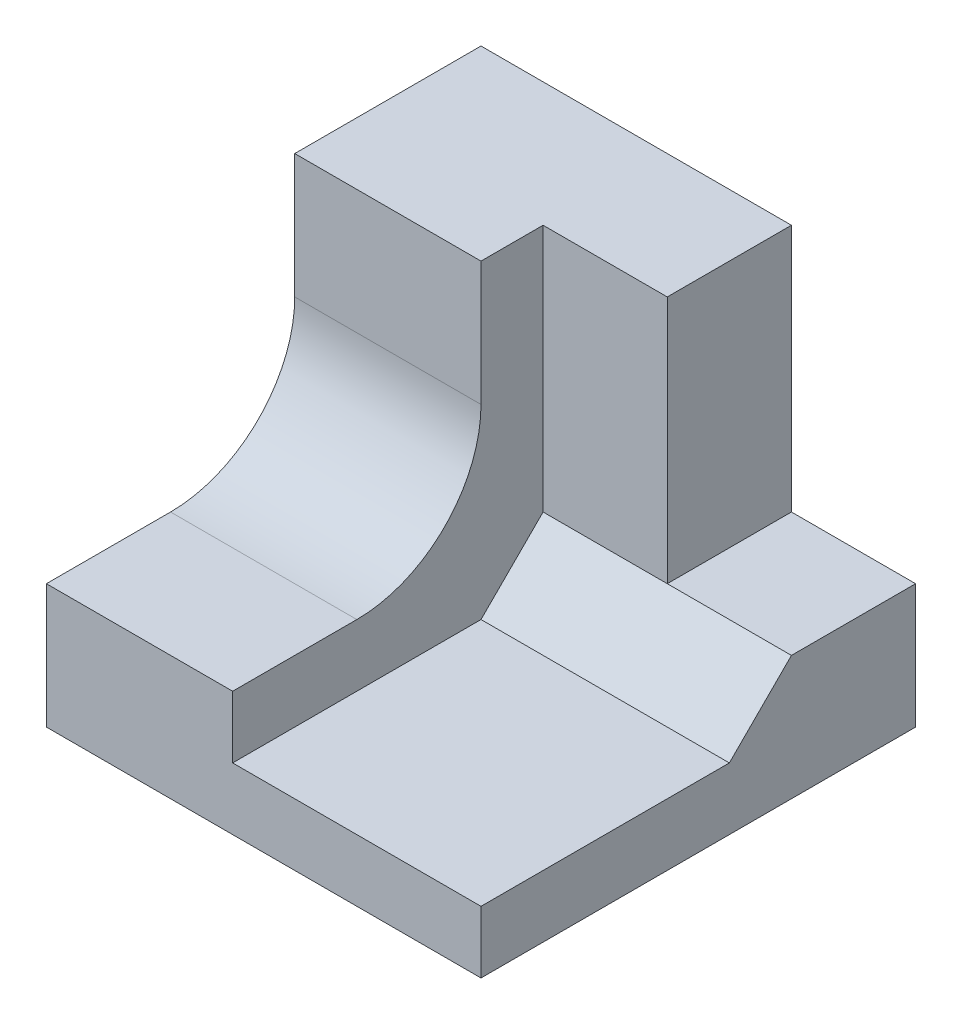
ISO-10303-21;
HEADER;
FILE_DESCRIPTION(('STEP AP214'),'2;1');
FILE_NAME('part.step','',(''),(''),'','','');
FILE_SCHEMA(('AUTOMOTIVE_DESIGN { 1 0 10303 214 1 1 1 1 }'));
ENDSEC;
DATA;
#1=APPLICATION_CONTEXT('core data for automotive mechanical design processes');
#2=APPLICATION_PROTOCOL_DEFINITION('international standard','automotive_design',2000,#1);
#3=PRODUCT_CONTEXT('',#1,'mechanical');
#4=PRODUCT('Part','Part','',(#3));
#5=PRODUCT_RELATED_PRODUCT_CATEGORY('part','',(#4));
#6=PRODUCT_DEFINITION_FORMATION('','',#4);
#7=PRODUCT_DEFINITION_CONTEXT('part definition',#1,'design');
#8=PRODUCT_DEFINITION('design','',#6,#7);
#9=PRODUCT_DEFINITION_SHAPE('','',#8);
#10=(LENGTH_UNIT() NAMED_UNIT(*) SI_UNIT(.MILLI.,.METRE.));
#11=(NAMED_UNIT(*) PLANE_ANGLE_UNIT() SI_UNIT($,.RADIAN.));
#12=(NAMED_UNIT(*) SI_UNIT($,.STERADIAN.) SOLID_ANGLE_UNIT());
#13=UNCERTAINTY_MEASURE_WITH_UNIT(LENGTH_MEASURE(1.E-05),#10,'distance_accuracy_value','');
#14=(GEOMETRIC_REPRESENTATION_CONTEXT(3) GLOBAL_UNCERTAINTY_ASSIGNED_CONTEXT((#13)) GLOBAL_UNIT_ASSIGNED_CONTEXT((#10,
#11,#12)) REPRESENTATION_CONTEXT('',''));
#15=CARTESIAN_POINT('',(0.,0.,0.));
#16=DIRECTION('',(0.,0.,1.));
#17=DIRECTION('',(1.,0.,0.));
#18=AXIS2_PLACEMENT_3D('',#15,#16,#17);
#19=CARTESIAN_POINT('',(0.,60.,0.));
#20=DIRECTION('',(1.,0.,0.));
#21=DIRECTION('',(0.,0.,-1.));
#22=AXIS2_PLACEMENT_3D('',#19,#20,#21);
#23=PLANE('',#22);
#24=DIRECTION('',(0.,0.,-1.));
#25=VECTOR('',#24,1.);
#26=CARTESIAN_POINT('',(0.,20.,0.));
#27=LINE('',#26,#25);
#28=CARTESIAN_POINT('',(0.,20.,0.));
#29=VERTEX_POINT('',#28);
#30=CARTESIAN_POINT('',(0.,20.,-20.));
#31=VERTEX_POINT('',#30);
#32=EDGE_CURVE('E202',#29,#31,#27,.T.);
#33=ORIENTED_EDGE('',*,*,#32,.T.);
#34=CARTESIAN_POINT('',(0.,40.,-20.));
#35=DIRECTION('',(1.,0.,0.));
#36=DIRECTION('',(0.,0.,-1.));
#37=AXIS2_PLACEMENT_3D('',#34,#35,#36);
#38=CIRCLE('',#37,20.);
#39=CARTESIAN_POINT('',(0.,40.,-40.));
#40=VERTEX_POINT('',#39);
#41=EDGE_CURVE('E12',#31,#40,#38,.T.);
#42=ORIENTED_EDGE('',*,*,#41,.T.);
#43=DIRECTION('',(0.,1.,0.));
#44=VECTOR('',#43,1.);
#45=CARTESIAN_POINT('',(0.,60.,-40.));
#46=LINE('',#45,#44);
#47=CARTESIAN_POINT('',(0.,60.,-40.));
#48=VERTEX_POINT('',#47);
#49=EDGE_CURVE('E195',#40,#48,#46,.T.);
#50=ORIENTED_EDGE('',*,*,#49,.T.);
#51=DIRECTION('',(0.,0.,1.));
#52=VECTOR('',#51,1.);
#53=CARTESIAN_POINT('',(0.,60.,0.));
#54=LINE('',#53,#52);
#55=CARTESIAN_POINT('',(0.,60.,-70.));
#56=VERTEX_POINT('',#55);
#57=EDGE_CURVE('E152',#56,#48,#54,.T.);
#58=ORIENTED_EDGE('',*,*,#57,.F.);
#59=DIRECTION('',(0.,-1.,0.));
#60=VECTOR('',#59,1.);
#61=CARTESIAN_POINT('',(0.,60.,-70.));
#62=LINE('',#61,#60);
#63=CARTESIAN_POINT('',(0.,0.,-70.));
#64=VERTEX_POINT('',#63);
#65=EDGE_CURVE('E150',#56,#64,#62,.T.);
#66=ORIENTED_EDGE('',*,*,#65,.T.);
#67=DIRECTION('',(0.,0.,1.));
#68=VECTOR('',#67,1.);
#69=CARTESIAN_POINT('',(0.,0.,0.));
#70=LINE('',#69,#68);
#71=CARTESIAN_POINT('',(0.,0.,0.));
#72=VERTEX_POINT('',#71);
#73=EDGE_CURVE('E160',#64,#72,#70,.T.);
#74=ORIENTED_EDGE('',*,*,#73,.T.);
#75=DIRECTION('',(0.,-1.,0.));
#76=VECTOR('',#75,1.);
#77=CARTESIAN_POINT('',(0.,60.,0.));
#78=LINE('',#77,#76);
#79=EDGE_CURVE('E174',#29,#72,#78,.T.);
#80=ORIENTED_EDGE('',*,*,#79,.F.);
#81=EDGE_LOOP('',(#33,#42,#50,#58,#66,#74,#80));
#82=FACE_BOUND('',#81,.T.);
#83=ADVANCED_FACE('F33',(#82),#23,.F.);
#84=CARTESIAN_POINT('',(0.,60.,0.));
#85=DIRECTION('',(0.,0.,-1.));
#86=DIRECTION('',(-1.,0.,0.));
#87=AXIS2_PLACEMENT_3D('',#84,#85,#86);
#88=PLANE('',#87);
#89=DIRECTION('',(0.,1.,0.));
#90=VECTOR('',#89,1.);
#91=CARTESIAN_POINT('',(30.,-64.0312423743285,0.));
#92=LINE('',#91,#90);
#93=CARTESIAN_POINT('',(30.,9.99999999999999,0.));
#94=VERTEX_POINT('',#93);
#95=CARTESIAN_POINT('',(30.,20.,0.));
#96=VERTEX_POINT('',#95);
#97=EDGE_CURVE('E221',#94,#96,#92,.T.);
#98=ORIENTED_EDGE('',*,*,#97,.T.);
#99=DIRECTION('',(1.,0.,0.));
#100=VECTOR('',#99,1.);
#101=CARTESIAN_POINT('',(0.,20.,0.));
#102=LINE('',#101,#100);
#103=EDGE_CURVE('E212',#29,#96,#102,.T.);
#104=ORIENTED_EDGE('',*,*,#103,.F.);
#105=ORIENTED_EDGE('',*,*,#79,.T.);
#106=DIRECTION('',(1.,0.,0.));
#107=VECTOR('',#106,1.);
#108=CARTESIAN_POINT('',(0.,0.,0.));
#109=LINE('',#108,#107);
#110=CARTESIAN_POINT('',(70.,0.,0.));
#111=VERTEX_POINT('',#110);
#112=EDGE_CURVE('E163',#72,#111,#109,.T.);
#113=ORIENTED_EDGE('',*,*,#112,.T.);
#114=DIRECTION('',(0.,-1.,0.));
#115=VECTOR('',#114,1.);
#116=CARTESIAN_POINT('',(70.,60.,0.));
#117=LINE('',#116,#115);
#118=CARTESIAN_POINT('',(70.,9.99999999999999,0.));
#119=VERTEX_POINT('',#118);
#120=EDGE_CURVE('E172',#119,#111,#117,.T.);
#121=ORIENTED_EDGE('',*,*,#120,.F.);
#122=DIRECTION('',(1.,0.,0.));
#123=VECTOR('',#122,1.);
#124=CARTESIAN_POINT('',(70.,9.99999999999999,0.));
#125=LINE('',#124,#123);
#126=EDGE_CURVE('E219',#94,#119,#125,.T.);
#127=ORIENTED_EDGE('',*,*,#126,.F.);
#128=EDGE_LOOP('',(#98,#104,#105,#113,#121,#127));
#129=FACE_BOUND('',#128,.T.);
#130=ADVANCED_FACE('F253',(#129),#88,.F.);
#131=CARTESIAN_POINT('',(70.,60.,0.));
#132=DIRECTION('',(-1.,0.,0.));
#133=DIRECTION('',(0.,0.,1.));
#134=AXIS2_PLACEMENT_3D('',#131,#132,#133);
#135=PLANE('',#134);
#136=DIRECTION('',(0.,-1.,0.));
#137=VECTOR('',#136,1.);
#138=CARTESIAN_POINT('',(70.,60.,-70.));
#139=LINE('',#138,#137);
#140=CARTESIAN_POINT('',(70.,20.,-70.));
#141=VERTEX_POINT('',#140);
#142=CARTESIAN_POINT('',(70.,0.,-70.));
#143=VERTEX_POINT('',#142);
#144=EDGE_CURVE('E154',#141,#143,#139,.T.);
#145=ORIENTED_EDGE('',*,*,#144,.F.);
#146=DIRECTION('',(0.,0.,1.));
#147=VECTOR('',#146,1.);
#148=CARTESIAN_POINT('',(70.,20.,-70.));
#149=LINE('',#148,#147);
#150=CARTESIAN_POINT('',(70.,20.,-50.));
#151=VERTEX_POINT('',#150);
#152=EDGE_CURVE('E206',#141,#151,#149,.T.);
#153=ORIENTED_EDGE('',*,*,#152,.T.);
#154=DIRECTION('',(0.,0.707106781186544,-0.707106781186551));
#155=VECTOR('',#154,1.);
#156=CARTESIAN_POINT('',(70.,14.9999999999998,-44.9999999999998));
#157=LINE('',#156,#155);
#158=CARTESIAN_POINT('',(70.,9.99999999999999,-39.9999999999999));
#159=VERTEX_POINT('',#158);
#160=EDGE_CURVE('E183',#151,#159,#157,.F.);
#161=ORIENTED_EDGE('',*,*,#160,.T.);
#162=DIRECTION('',(0.,0.,-1.));
#163=VECTOR('',#162,1.);
#164=CARTESIAN_POINT('',(70.,9.99999999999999,0.));
#165=LINE('',#164,#163);
#166=EDGE_CURVE('E164',#119,#159,#165,.T.);
#167=ORIENTED_EDGE('',*,*,#166,.F.);
#168=ORIENTED_EDGE('',*,*,#120,.T.);
#169=DIRECTION('',(0.,0.,-1.));
#170=VECTOR('',#169,1.);
#171=CARTESIAN_POINT('',(70.,0.,0.));
#172=LINE('',#171,#170);
#173=EDGE_CURVE('E167',#111,#143,#172,.T.);
#174=ORIENTED_EDGE('',*,*,#173,.T.);
#175=EDGE_LOOP('',(#145,#153,#161,#167,#168,#174));
#176=FACE_BOUND('',#175,.T.);
#177=ADVANCED_FACE('F241',(#176),#135,.F.);
#178=CARTESIAN_POINT('',(0.,60.,-70.));
#179=DIRECTION('',(0.,0.,1.));
#180=DIRECTION('',(1.,0.,0.));
#181=AXIS2_PLACEMENT_3D('',#178,#179,#180);
#182=PLANE('',#181);
#183=DIRECTION('',(0.,-1.,0.));
#184=VECTOR('',#183,1.);
#185=CARTESIAN_POINT('',(50.,60.,-70.));
#186=LINE('',#185,#184);
#187=CARTESIAN_POINT('',(50.,60.,-70.));
#188=VERTEX_POINT('',#187);
#189=CARTESIAN_POINT('',(50.,20.,-70.));
#190=VERTEX_POINT('',#189);
#191=EDGE_CURVE('E123',#188,#190,#186,.T.);
#192=ORIENTED_EDGE('',*,*,#191,.T.);
#193=DIRECTION('',(1.,0.,0.));
#194=VECTOR('',#193,1.);
#195=CARTESIAN_POINT('',(70.,20.,-70.));
#196=LINE('',#195,#194);
#197=EDGE_CURVE('E135',#190,#141,#196,.T.);
#198=ORIENTED_EDGE('',*,*,#197,.T.);
#199=ORIENTED_EDGE('',*,*,#144,.T.);
#200=DIRECTION('',(-1.,0.,0.));
#201=VECTOR('',#200,1.);
#202=CARTESIAN_POINT('',(0.,0.,-70.));
#203=LINE('',#202,#201);
#204=EDGE_CURVE('E156',#143,#64,#203,.T.);
#205=ORIENTED_EDGE('',*,*,#204,.T.);
#206=ORIENTED_EDGE('',*,*,#65,.F.);
#207=DIRECTION('',(-1.,0.,0.));
#208=VECTOR('',#207,1.);
#209=CARTESIAN_POINT('',(0.,60.,-70.));
#210=LINE('',#209,#208);
#211=EDGE_CURVE('E142',#188,#56,#210,.T.);
#212=ORIENTED_EDGE('',*,*,#211,.F.);
#213=EDGE_LOOP('',(#192,#198,#199,#205,#206,#212));
#214=FACE_BOUND('',#213,.T.);
#215=ADVANCED_FACE('F148',(#214),#182,.F.);
#216=CARTESIAN_POINT('',(0.,60.,-70.));
#217=DIRECTION('',(0.,-1.,0.));
#218=DIRECTION('',(0.,0.,-1.));
#219=AXIS2_PLACEMENT_3D('',#216,#217,#218);
#220=PLANE('',#219);
#221=DIRECTION('',(-1.,0.,0.));
#222=VECTOR('',#221,1.);
#223=CARTESIAN_POINT('',(70.,60.,-50.));
#224=LINE('',#223,#222);
#225=CARTESIAN_POINT('',(50.,60.,-50.));
#226=VERTEX_POINT('',#225);
#227=CARTESIAN_POINT('',(30.,60.,-50.));
#228=VERTEX_POINT('',#227);
#229=EDGE_CURVE('E146',#226,#228,#224,.T.);
#230=ORIENTED_EDGE('',*,*,#229,.F.);
#231=DIRECTION('',(0.,0.,1.));
#232=VECTOR('',#231,1.);
#233=CARTESIAN_POINT('',(50.,60.,-70.));
#234=LINE('',#233,#232);
#235=EDGE_CURVE('E127',#188,#226,#234,.T.);
#236=ORIENTED_EDGE('',*,*,#235,.F.);
#237=ORIENTED_EDGE('',*,*,#211,.T.);
#238=ORIENTED_EDGE('',*,*,#57,.T.);
#239=DIRECTION('',(1.,0.,0.));
#240=VECTOR('',#239,1.);
#241=CARTESIAN_POINT('',(0.,60.,-40.));
#242=LINE('',#241,#240);
#243=CARTESIAN_POINT('',(30.,60.,-40.));
#244=VERTEX_POINT('',#243);
#245=EDGE_CURVE('E210',#48,#244,#242,.T.);
#246=ORIENTED_EDGE('',*,*,#245,.T.);
#247=DIRECTION('',(0.,0.,1.));
#248=VECTOR('',#247,1.);
#249=CARTESIAN_POINT('',(30.,60.,0.));
#250=LINE('',#249,#248);
#251=EDGE_CURVE('E201',#228,#244,#250,.T.);
#252=ORIENTED_EDGE('',*,*,#251,.F.);
#253=EDGE_LOOP('',(#230,#236,#237,#238,#246,#252));
#254=FACE_BOUND('',#253,.T.);
#255=ADVANCED_FACE('F140',(#254),#220,.F.);
#256=CARTESIAN_POINT('',(0.,0.,-70.));
#257=DIRECTION('',(0.,-1.,0.));
#258=DIRECTION('',(0.,0.,-1.));
#259=AXIS2_PLACEMENT_3D('',#256,#257,#258);
#260=PLANE('',#259);
#261=ORIENTED_EDGE('',*,*,#73,.F.);
#262=ORIENTED_EDGE('',*,*,#204,.F.);
#263=ORIENTED_EDGE('',*,*,#173,.F.);
#264=ORIENTED_EDGE('',*,*,#112,.F.);
#265=EDGE_LOOP('',(#261,#262,#263,#264));
#266=FACE_BOUND('',#265,.T.);
#267=ADVANCED_FACE('F249',(#266),#260,.T.);
#268=CARTESIAN_POINT('',(0.,10.,-70.));
#269=DIRECTION('',(0.,-1.,0.));
#270=DIRECTION('',(0.,0.,-1.));
#271=AXIS2_PLACEMENT_3D('',#268,#269,#270);
#272=PLANE('',#271);
#273=ORIENTED_EDGE('',*,*,#166,.T.);
#274=DIRECTION('',(-1.,0.,0.));
#275=VECTOR('',#274,1.);
#276=CARTESIAN_POINT('',(30.,10.,-39.9999999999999));
#277=LINE('',#276,#275);
#278=CARTESIAN_POINT('',(30.,10.,-39.9999999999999));
#279=VERTEX_POINT('',#278);
#280=EDGE_CURVE('E176',#159,#279,#277,.T.);
#281=ORIENTED_EDGE('',*,*,#280,.T.);
#282=DIRECTION('',(0.,0.,1.));
#283=VECTOR('',#282,1.);
#284=CARTESIAN_POINT('',(30.,9.99999999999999,0.));
#285=LINE('',#284,#283);
#286=EDGE_CURVE('E222',#279,#94,#285,.T.);
#287=ORIENTED_EDGE('',*,*,#286,.T.);
#288=ORIENTED_EDGE('',*,*,#126,.T.);
#289=EDGE_LOOP('',(#273,#281,#287,#288));
#290=FACE_BOUND('',#289,.T.);
#291=ADVANCED_FACE('F258',(#290),#272,.F.);
#292=CARTESIAN_POINT('',(70.,-64.0312423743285,-50.));
#293=DIRECTION('',(0.,0.,-1.));
#294=DIRECTION('',(-1.,0.,0.));
#295=AXIS2_PLACEMENT_3D('',#292,#293,#294);
#296=PLANE('',#295);
#297=DIRECTION('',(0.,1.,0.));
#298=VECTOR('',#297,1.);
#299=CARTESIAN_POINT('',(30.,-64.0312423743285,-50.));
#300=LINE('',#299,#298);
#301=CARTESIAN_POINT('',(30.,19.9999999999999,-50.));
#302=VERTEX_POINT('',#301);
#303=EDGE_CURVE('E215',#302,#228,#300,.T.);
#304=ORIENTED_EDGE('',*,*,#303,.F.);
#305=DIRECTION('',(1.,0.,0.));
#306=VECTOR('',#305,1.);
#307=CARTESIAN_POINT('',(70.,19.9999999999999,-50.));
#308=LINE('',#307,#306);
#309=CARTESIAN_POINT('',(50.,20.,-50.));
#310=VERTEX_POINT('',#309);
#311=EDGE_CURVE('E181',#302,#310,#308,.T.);
#312=ORIENTED_EDGE('',*,*,#311,.T.);
#313=DIRECTION('',(0.,-1.,0.));
#314=VECTOR('',#313,1.);
#315=CARTESIAN_POINT('',(50.,60.,-50.));
#316=LINE('',#315,#314);
#317=EDGE_CURVE('E229',#226,#310,#316,.T.);
#318=ORIENTED_EDGE('',*,*,#317,.F.);
#319=ORIENTED_EDGE('',*,*,#229,.T.);
#320=EDGE_LOOP('',(#304,#312,#318,#319));
#321=FACE_BOUND('',#320,.T.);
#322=ADVANCED_FACE('F228',(#321),#296,.F.);
#323=CARTESIAN_POINT('',(30.,-64.0312423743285,0.));
#324=DIRECTION('',(-1.,0.,0.));
#325=DIRECTION('',(0.,0.,1.));
#326=AXIS2_PLACEMENT_3D('',#323,#324,#325);
#327=PLANE('',#326);
#328=ORIENTED_EDGE('',*,*,#286,.F.);
#329=DIRECTION('',(0.,-0.707106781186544,0.707106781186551));
#330=VECTOR('',#329,1.);
#331=CARTESIAN_POINT('',(30.,9.99999999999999,-39.9999999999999));
#332=LINE('',#331,#330);
#333=EDGE_CURVE('E179',#279,#302,#332,.F.);
#334=ORIENTED_EDGE('',*,*,#333,.T.);
#335=ORIENTED_EDGE('',*,*,#303,.T.);
#336=ORIENTED_EDGE('',*,*,#251,.T.);
#337=DIRECTION('',(0.,1.,0.));
#338=VECTOR('',#337,1.);
#339=CARTESIAN_POINT('',(30.,60.,-40.));
#340=LINE('',#339,#338);
#341=CARTESIAN_POINT('',(30.,40.,-40.));
#342=VERTEX_POINT('',#341);
#343=EDGE_CURVE('E193',#342,#244,#340,.T.);
#344=ORIENTED_EDGE('',*,*,#343,.F.);
#345=CARTESIAN_POINT('',(30.,40.,-20.));
#346=DIRECTION('',(-1.,0.,0.));
#347=DIRECTION('',(0.,0.,1.));
#348=AXIS2_PLACEMENT_3D('',#345,#346,#347);
#349=CIRCLE('',#348,20.);
#350=CARTESIAN_POINT('',(30.,20.,-20.));
#351=VERTEX_POINT('',#350);
#352=EDGE_CURVE('E41',#342,#351,#349,.T.);
#353=ORIENTED_EDGE('',*,*,#352,.T.);
#354=DIRECTION('',(0.,0.,-1.));
#355=VECTOR('',#354,1.);
#356=CARTESIAN_POINT('',(30.,20.,0.));
#357=LINE('',#356,#355);
#358=EDGE_CURVE('E203',#96,#351,#357,.T.);
#359=ORIENTED_EDGE('',*,*,#358,.F.);
#360=ORIENTED_EDGE('',*,*,#97,.F.);
#361=EDGE_LOOP('',(#328,#334,#335,#336,#344,#353,#359,#360));
#362=FACE_BOUND('',#361,.T.);
#363=ADVANCED_FACE('F200',(#362),#327,.F.);
#364=CARTESIAN_POINT('',(0.,60.,-40.));
#365=DIRECTION('',(0.,0.,-1.));
#366=DIRECTION('',(0.,1.,0.));
#367=AXIS2_PLACEMENT_3D('',#364,#365,#366);
#368=PLANE('',#367);
#369=ORIENTED_EDGE('',*,*,#49,.F.);
#370=DIRECTION('',(1.,0.,0.));
#371=VECTOR('',#370,1.);
#372=CARTESIAN_POINT('',(30.,40.,-40.));
#373=LINE('',#372,#371);
#374=EDGE_CURVE('E185',#40,#342,#373,.T.);
#375=ORIENTED_EDGE('',*,*,#374,.T.);
#376=ORIENTED_EDGE('',*,*,#343,.T.);
#377=ORIENTED_EDGE('',*,*,#245,.F.);
#378=EDGE_LOOP('',(#369,#375,#376,#377));
#379=FACE_BOUND('',#378,.T.);
#380=ADVANCED_FACE('F191',(#379),#368,.F.);
#381=CARTESIAN_POINT('',(0.,20.,0.));
#382=DIRECTION('',(0.,-1.,0.));
#383=DIRECTION('',(0.,0.,-1.));
#384=AXIS2_PLACEMENT_3D('',#381,#382,#383);
#385=PLANE('',#384);
#386=ORIENTED_EDGE('',*,*,#358,.T.);
#387=DIRECTION('',(1.,0.,0.));
#388=VECTOR('',#387,1.);
#389=CARTESIAN_POINT('',(0.,20.,-20.));
#390=LINE('',#389,#388);
#391=EDGE_CURVE('E48',#351,#31,#390,.F.);
#392=ORIENTED_EDGE('',*,*,#391,.T.);
#393=ORIENTED_EDGE('',*,*,#32,.F.);
#394=ORIENTED_EDGE('',*,*,#103,.T.);
#395=EDGE_LOOP('',(#386,#392,#393,#394));
#396=FACE_BOUND('',#395,.T.);
#397=ADVANCED_FACE('F256',(#396),#385,.F.);
#398=CARTESIAN_POINT('',(70.,20.,-70.));
#399=DIRECTION('',(0.,-1.,0.));
#400=DIRECTION('',(1.,0.,0.));
#401=AXIS2_PLACEMENT_3D('',#398,#399,#400);
#402=PLANE('',#401);
#403=DIRECTION('',(1.,0.,0.));
#404=VECTOR('',#403,1.);
#405=CARTESIAN_POINT('',(70.,20.,-50.));
#406=LINE('',#405,#404);
#407=EDGE_CURVE('E136',#310,#151,#406,.T.);
#408=ORIENTED_EDGE('',*,*,#407,.T.);
#409=ORIENTED_EDGE('',*,*,#152,.F.);
#410=ORIENTED_EDGE('',*,*,#197,.F.);
#411=DIRECTION('',(0.,0.,1.));
#412=VECTOR('',#411,1.);
#413=CARTESIAN_POINT('',(50.,20.,-70.));
#414=LINE('',#413,#412);
#415=EDGE_CURVE('E130',#190,#310,#414,.T.);
#416=ORIENTED_EDGE('',*,*,#415,.T.);
#417=EDGE_LOOP('',(#408,#409,#410,#416));
#418=FACE_BOUND('',#417,.T.);
#419=ADVANCED_FACE('F263',(#418),#402,.F.);
#420=CARTESIAN_POINT('',(50.,60.,-70.));
#421=DIRECTION('',(-1.,0.,0.));
#422=DIRECTION('',(0.,0.,1.));
#423=AXIS2_PLACEMENT_3D('',#420,#421,#422);
#424=PLANE('',#423);
#425=ORIENTED_EDGE('',*,*,#317,.T.);
#426=ORIENTED_EDGE('',*,*,#415,.F.);
#427=ORIENTED_EDGE('',*,*,#191,.F.);
#428=ORIENTED_EDGE('',*,*,#235,.T.);
#429=EDGE_LOOP('',(#425,#426,#427,#428));
#430=FACE_BOUND('',#429,.T.);
#431=ADVANCED_FACE('F126',(#430),#424,.F.);
#432=CARTESIAN_POINT('',(0.,10.,-39.9999999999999));
#433=DIRECTION('',(0.,0.707106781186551,0.707106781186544));
#434=DIRECTION('',(0.,-0.707106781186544,0.707106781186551));
#435=AXIS2_PLACEMENT_3D('',#432,#433,#434);
#436=PLANE('',#435);
#437=ORIENTED_EDGE('',*,*,#407,.F.);
#438=ORIENTED_EDGE('',*,*,#311,.F.);
#439=ORIENTED_EDGE('',*,*,#333,.F.);
#440=ORIENTED_EDGE('',*,*,#280,.F.);
#441=ORIENTED_EDGE('',*,*,#160,.F.);
#442=EDGE_LOOP('',(#437,#438,#439,#440,#441));
#443=FACE_BOUND('',#442,.T.);
#444=ADVANCED_FACE('F262',(#443),#436,.T.);
#445=CARTESIAN_POINT('',(0.,40.,-20.));
#446=DIRECTION('',(-1.,0.,0.));
#447=DIRECTION('',(0.,0.,1.));
#448=AXIS2_PLACEMENT_3D('',#445,#446,#447);
#449=CYLINDRICAL_SURFACE('',#448,20.);
#450=ORIENTED_EDGE('',*,*,#41,.F.);
#451=ORIENTED_EDGE('',*,*,#391,.F.);
#452=ORIENTED_EDGE('',*,*,#352,.F.);
#453=ORIENTED_EDGE('',*,*,#374,.F.);
#454=EDGE_LOOP('',(#450,#451,#452,#453));
#455=FACE_BOUND('',#454,.T.);
#456=ADVANCED_FACE('F35',(#455),#449,.F.);
#457=CLOSED_SHELL('',(#83,#130,#177,#215,#255,#267,#291,#322,#363,#380,#397,#419,#431,#444,#456));
#458=MANIFOLD_SOLID_BREP('B2',#457);
#459=ADVANCED_BREP_SHAPE_REPRESENTATION('',(#18,#458),#14);
#460=SHAPE_DEFINITION_REPRESENTATION(#9,#459);
ENDSEC;
END-ISO-10303-21;
